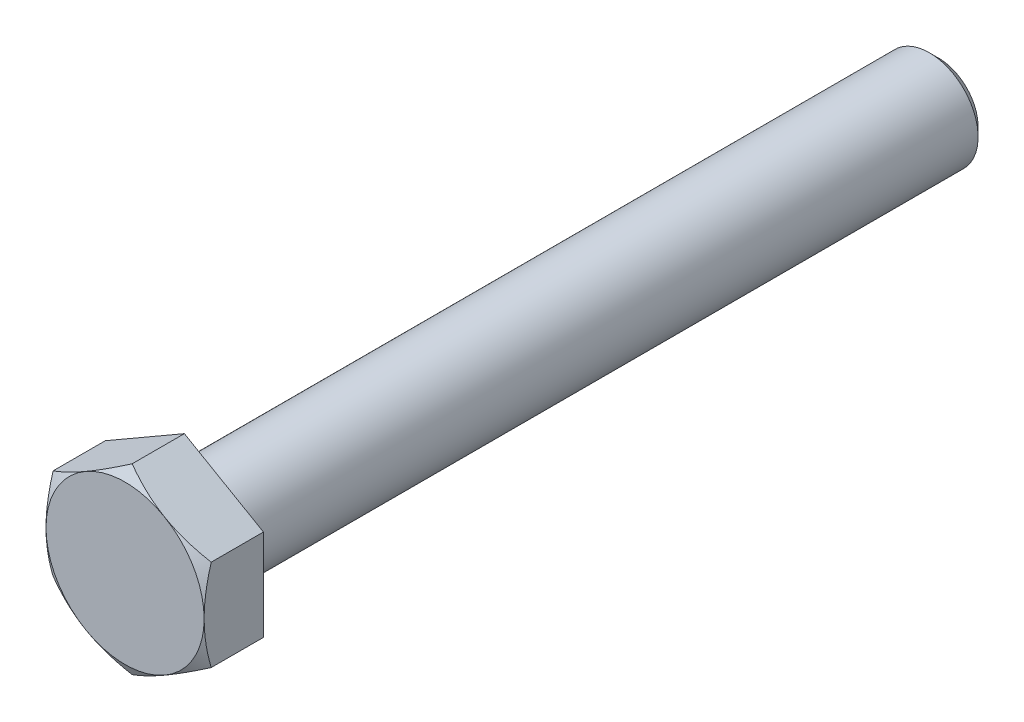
from build123d import *

# Parameters (mm, degrees)
BOSS_EXTRUDE1_DEPTH = 15.478125
SKETCH5_OUTSIDE_W   = 834.626
SKETCH5_OUTSIDE_H   = 841.012
SKETCH5_OUTSIDE_R   = 20.6375
CUT_EXTRUDE1_DEPTH  = 215.655571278
CUT_EXTRUDE1_DRAFT  = -60
CHAMFER1_SIZE       = 0.508


with BuildPart() as part:
    # Sketch3 → Revolve1 (revolve)
    with BuildSketch(Plane(origin=(0, 0, 0), x_dir=(0, 0, -1), z_dir=(1, 0, 0)), mode=Mode.PRIVATE) as revolve1_sk:
        Polygon((-106.1640625, 0), (-106.1640625, 20.6375), (-90.6859375, 20.6375), (-90.6859375, 12.7), (103.7828125, 12.7), (106.1640625, 10.31875), (106.1640625, 0), align=None)
    revolve(revolve1_sk.sketch.rotate(Axis((0, 0, -106.1640625), (0, 0, 1)), 90), axis=Axis((0, 0, -106.1640625), (0, 0, 1)))

    # Sketch4 → Boss-Extrude1 (add)
    with BuildSketch(Plane.XY.offset(106.1640625)):
        Polygon((0, -23.830132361), (20.6375, -11.91506618), (20.6375, 11.91506618), (0, 23.830132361), (-20.6375, 11.91506618), (-20.6375, -11.91506618), align=None)
    extrude(amount=-BOSS_EXTRUDE1_DEPTH)


with BuildPart() as cut_extrude1_tool:
    # Sketch5 outside → Cut-Extrude1 (with draft: the straight prism first)
    with BuildSketch(Plane.XY.offset(106.1640625)):
        Rectangle(SKETCH5_OUTSIDE_W, SKETCH5_OUTSIDE_H)
        Circle(SKETCH5_OUTSIDE_R, mode=Mode.SUBTRACT)
    extrude(amount=-CUT_EXTRUDE1_DEPTH)
    # Cut-Extrude1: the draft: its side faces are tilted about the plane it starts from
    cut_extrude1_sides = [cut_extrude1_tool.faces().sort_by_distance(p)[0] for p in [
        (0, -420.506, -1.663723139),
        (417.313, 0, -1.663723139),
        (0, 420.506, -1.663723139),
        (-417.313, 0, -1.663723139),
        (-20.6375, 0, -1.663723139),
    ]]
    draft(cut_extrude1_sides, Plane.XY.offset(106.1640625), CUT_EXTRUDE1_DRAFT)


with BuildPart() as part_1:
    add(part.part)

    # Cut-Extrude1: cut by cut_extrude1_tool
    add(cut_extrude1_tool.part, mode=Mode.SUBTRACT)

    # Chamfer1
    chamfer1_edges = [part_1.edges().sort_by_distance(p)[0] for p in [
        (12.7, 0, 90.6859375),
    ]]
    chamfer(chamfer1_edges, length=CHAMFER1_SIZE)


solid = part_1.part
